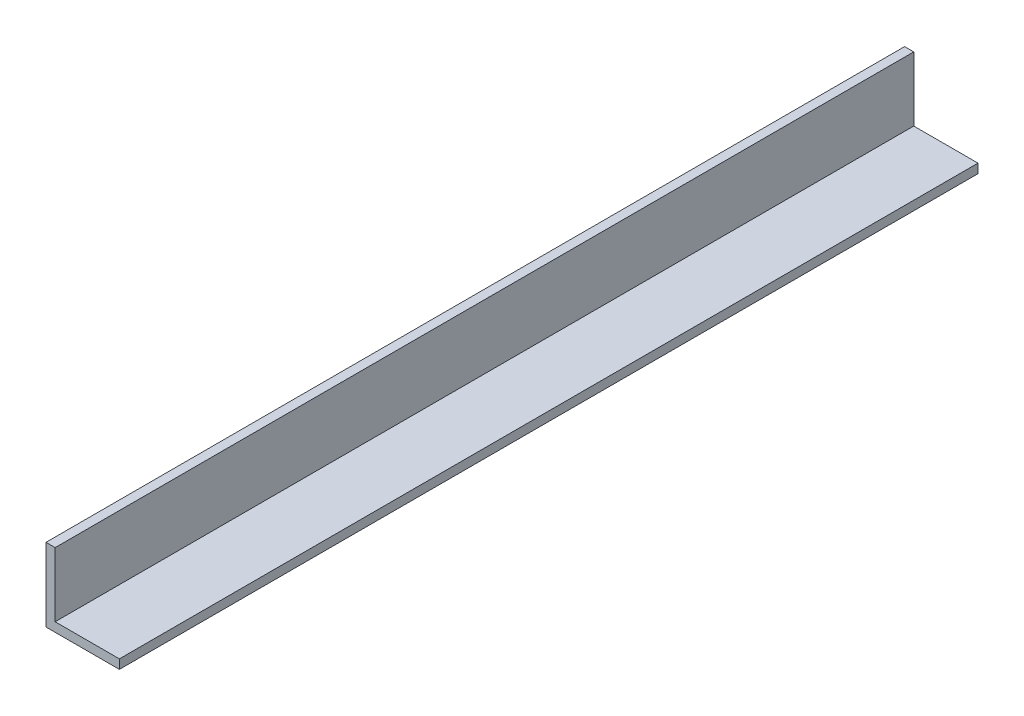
ISO-10303-21;
HEADER;
FILE_DESCRIPTION(('STEP AP214'),'2;1');
FILE_NAME('part.step','',(''),(''),'','','');
FILE_SCHEMA(('AUTOMOTIVE_DESIGN { 1 0 10303 214 1 1 1 1 }'));
ENDSEC;
DATA;
#1=APPLICATION_CONTEXT('core data for automotive mechanical design processes');
#2=APPLICATION_PROTOCOL_DEFINITION('international standard','automotive_design',2000,#1);
#3=PRODUCT_CONTEXT('',#1,'mechanical');
#4=PRODUCT('Part','Part','',(#3));
#5=PRODUCT_RELATED_PRODUCT_CATEGORY('part','',(#4));
#6=PRODUCT_DEFINITION_FORMATION('','',#4);
#7=PRODUCT_DEFINITION_CONTEXT('part definition',#1,'design');
#8=PRODUCT_DEFINITION('design','',#6,#7);
#9=PRODUCT_DEFINITION_SHAPE('','',#8);
#10=(LENGTH_UNIT() NAMED_UNIT(*) SI_UNIT(.MILLI.,.METRE.));
#11=(NAMED_UNIT(*) PLANE_ANGLE_UNIT() SI_UNIT($,.RADIAN.));
#12=(NAMED_UNIT(*) SI_UNIT($,.STERADIAN.) SOLID_ANGLE_UNIT());
#13=UNCERTAINTY_MEASURE_WITH_UNIT(LENGTH_MEASURE(1.E-05),#10,'distance_accuracy_value','');
#14=(GEOMETRIC_REPRESENTATION_CONTEXT(3) GLOBAL_UNCERTAINTY_ASSIGNED_CONTEXT((#13)) GLOBAL_UNIT_ASSIGNED_CONTEXT((#10,
#11,#12)) REPRESENTATION_CONTEXT('',''));
#15=CARTESIAN_POINT('',(0.,0.,0.));
#16=DIRECTION('',(0.,0.,1.));
#17=DIRECTION('',(1.,0.,0.));
#18=AXIS2_PLACEMENT_3D('',#15,#16,#17);
#19=CARTESIAN_POINT('',(0.,0.,445.77));
#20=DIRECTION('',(0.,1.,0.));
#21=DIRECTION('',(0.,0.,1.));
#22=AXIS2_PLACEMENT_3D('',#19,#20,#21);
#23=PLANE('',#22);
#24=DIRECTION('',(1.,0.,0.));
#25=VECTOR('',#24,1.);
#26=CARTESIAN_POINT('',(0.,0.,0.));
#27=LINE('',#26,#25);
#28=CARTESIAN_POINT('',(0.,0.,0.));
#29=VERTEX_POINT('',#28);
#30=CARTESIAN_POINT('',(38.1,0.,0.));
#31=VERTEX_POINT('',#30);
#32=EDGE_CURVE('E116',#29,#31,#27,.T.);
#33=ORIENTED_EDGE('',*,*,#32,.T.);
#34=DIRECTION('',(0.,0.,-1.));
#35=VECTOR('',#34,1.);
#36=CARTESIAN_POINT('',(38.1,0.,445.77));
#37=LINE('',#36,#35);
#38=CARTESIAN_POINT('',(38.1,0.,445.77));
#39=VERTEX_POINT('',#38);
#40=EDGE_CURVE('E11',#39,#31,#37,.T.);
#41=ORIENTED_EDGE('',*,*,#40,.F.);
#42=DIRECTION('',(1.,0.,0.));
#43=VECTOR('',#42,1.);
#44=CARTESIAN_POINT('',(0.,0.,445.77));
#45=LINE('',#44,#43);
#46=CARTESIAN_POINT('',(0.,0.,445.77));
#47=VERTEX_POINT('',#46);
#48=EDGE_CURVE('E126',#47,#39,#45,.T.);
#49=ORIENTED_EDGE('',*,*,#48,.F.);
#50=DIRECTION('',(0.,0.,-1.));
#51=VECTOR('',#50,1.);
#52=CARTESIAN_POINT('',(0.,0.,445.77));
#53=LINE('',#52,#51);
#54=EDGE_CURVE('E112',#47,#29,#53,.T.);
#55=ORIENTED_EDGE('',*,*,#54,.T.);
#56=EDGE_LOOP('',(#33,#41,#49,#55));
#57=FACE_BOUND('',#56,.T.);
#58=ADVANCED_FACE('F32',(#57),#23,.F.);
#59=CARTESIAN_POINT('',(38.1,0.,445.77));
#60=DIRECTION('',(-1.,0.,0.));
#61=DIRECTION('',(0.,0.,1.));
#62=AXIS2_PLACEMENT_3D('',#59,#60,#61);
#63=PLANE('',#62);
#64=DIRECTION('',(0.,1.,0.));
#65=VECTOR('',#64,1.);
#66=CARTESIAN_POINT('',(38.1,0.,0.));
#67=LINE('',#66,#65);
#68=CARTESIAN_POINT('',(38.1,4.7498,0.));
#69=VERTEX_POINT('',#68);
#70=EDGE_CURVE('E119',#31,#69,#67,.T.);
#71=ORIENTED_EDGE('',*,*,#70,.T.);
#72=DIRECTION('',(0.,0.,-1.));
#73=VECTOR('',#72,1.);
#74=CARTESIAN_POINT('',(38.1,4.7498,445.77));
#75=LINE('',#74,#73);
#76=CARTESIAN_POINT('',(38.1,4.7498,445.77));
#77=VERTEX_POINT('',#76);
#78=EDGE_CURVE('E40',#77,#69,#75,.T.);
#79=ORIENTED_EDGE('',*,*,#78,.F.);
#80=DIRECTION('',(0.,1.,0.));
#81=VECTOR('',#80,1.);
#82=CARTESIAN_POINT('',(38.1,0.,445.77));
#83=LINE('',#82,#81);
#84=EDGE_CURVE('E85',#39,#77,#83,.T.);
#85=ORIENTED_EDGE('',*,*,#84,.F.);
#86=ORIENTED_EDGE('',*,*,#40,.T.);
#87=EDGE_LOOP('',(#71,#79,#85,#86));
#88=FACE_BOUND('',#87,.T.);
#89=ADVANCED_FACE('F150',(#88),#63,.F.);
#90=CARTESIAN_POINT('',(38.1,4.7498,445.77));
#91=DIRECTION('',(0.,-1.,0.));
#92=DIRECTION('',(1.,0.,0.));
#93=AXIS2_PLACEMENT_3D('',#90,#91,#92);
#94=PLANE('',#93);
#95=DIRECTION('',(-1.,0.,0.));
#96=VECTOR('',#95,1.);
#97=CARTESIAN_POINT('',(38.1,4.7498,0.));
#98=LINE('',#97,#96);
#99=CARTESIAN_POINT('',(4.7498,4.7498,0.));
#100=VERTEX_POINT('',#99);
#101=EDGE_CURVE('E121',#69,#100,#98,.T.);
#102=ORIENTED_EDGE('',*,*,#101,.T.);
#103=DIRECTION('',(0.,0.,-1.));
#104=VECTOR('',#103,1.);
#105=CARTESIAN_POINT('',(4.7498,4.7498,445.77));
#106=LINE('',#105,#104);
#107=CARTESIAN_POINT('',(4.7498,4.7498,445.77));
#108=VERTEX_POINT('',#107);
#109=EDGE_CURVE('E107',#108,#100,#106,.T.);
#110=ORIENTED_EDGE('',*,*,#109,.F.);
#111=DIRECTION('',(-1.,0.,0.));
#112=VECTOR('',#111,1.);
#113=CARTESIAN_POINT('',(38.1,4.7498,445.77));
#114=LINE('',#113,#112);
#115=EDGE_CURVE('E98',#77,#108,#114,.T.);
#116=ORIENTED_EDGE('',*,*,#115,.F.);
#117=ORIENTED_EDGE('',*,*,#78,.T.);
#118=EDGE_LOOP('',(#102,#110,#116,#117));
#119=FACE_BOUND('',#118,.T.);
#120=ADVANCED_FACE('F132',(#119),#94,.F.);
#121=CARTESIAN_POINT('',(4.7498,4.7498,445.77));
#122=DIRECTION('',(-1.,0.,0.));
#123=DIRECTION('',(0.,-1.,0.));
#124=AXIS2_PLACEMENT_3D('',#121,#122,#123);
#125=PLANE('',#124);
#126=DIRECTION('',(0.,1.,0.));
#127=VECTOR('',#126,1.);
#128=CARTESIAN_POINT('',(4.7498,4.7498,0.));
#129=LINE('',#128,#127);
#130=CARTESIAN_POINT('',(4.7498,38.1,0.));
#131=VERTEX_POINT('',#130);
#132=EDGE_CURVE('E106',#100,#131,#129,.T.);
#133=ORIENTED_EDGE('',*,*,#132,.T.);
#134=DIRECTION('',(0.,0.,-1.));
#135=VECTOR('',#134,1.);
#136=CARTESIAN_POINT('',(4.7498,38.1,445.77));
#137=LINE('',#136,#135);
#138=CARTESIAN_POINT('',(4.7498,38.1,445.77));
#139=VERTEX_POINT('',#138);
#140=EDGE_CURVE('E103',#139,#131,#137,.T.);
#141=ORIENTED_EDGE('',*,*,#140,.F.);
#142=DIRECTION('',(0.,1.,0.));
#143=VECTOR('',#142,1.);
#144=CARTESIAN_POINT('',(4.7498,4.7498,445.77));
#145=LINE('',#144,#143);
#146=EDGE_CURVE('E92',#108,#139,#145,.T.);
#147=ORIENTED_EDGE('',*,*,#146,.F.);
#148=ORIENTED_EDGE('',*,*,#109,.T.);
#149=EDGE_LOOP('',(#133,#141,#147,#148));
#150=FACE_BOUND('',#149,.T.);
#151=ADVANCED_FACE('F104',(#150),#125,.F.);
#152=CARTESIAN_POINT('',(4.7498,38.1,445.77));
#153=DIRECTION('',(0.,-1.,0.));
#154=DIRECTION('',(0.,0.,-1.));
#155=AXIS2_PLACEMENT_3D('',#152,#153,#154);
#156=PLANE('',#155);
#157=DIRECTION('',(-1.,0.,0.));
#158=VECTOR('',#157,1.);
#159=CARTESIAN_POINT('',(4.7498,38.1,0.));
#160=LINE('',#159,#158);
#161=CARTESIAN_POINT('',(0.,38.1,0.));
#162=VERTEX_POINT('',#161);
#163=EDGE_CURVE('E71',#131,#162,#160,.T.);
#164=ORIENTED_EDGE('',*,*,#163,.T.);
#165=DIRECTION('',(0.,0.,-1.));
#166=VECTOR('',#165,1.);
#167=CARTESIAN_POINT('',(0.,38.1,445.77));
#168=LINE('',#167,#166);
#169=CARTESIAN_POINT('',(0.,38.1,445.77));
#170=VERTEX_POINT('',#169);
#171=EDGE_CURVE('E108',#170,#162,#168,.T.);
#172=ORIENTED_EDGE('',*,*,#171,.F.);
#173=DIRECTION('',(-1.,0.,0.));
#174=VECTOR('',#173,1.);
#175=CARTESIAN_POINT('',(4.7498,38.1,445.77));
#176=LINE('',#175,#174);
#177=EDGE_CURVE('E96',#139,#170,#176,.T.);
#178=ORIENTED_EDGE('',*,*,#177,.F.);
#179=ORIENTED_EDGE('',*,*,#140,.T.);
#180=EDGE_LOOP('',(#164,#172,#178,#179));
#181=FACE_BOUND('',#180,.T.);
#182=ADVANCED_FACE('F110',(#181),#156,.F.);
#183=CARTESIAN_POINT('',(0.,0.,445.77));
#184=DIRECTION('',(1.,0.,0.));
#185=DIRECTION('',(0.,0.,-1.));
#186=AXIS2_PLACEMENT_3D('',#183,#184,#185);
#187=PLANE('',#186);
#188=DIRECTION('',(0.,-1.,0.));
#189=VECTOR('',#188,1.);
#190=CARTESIAN_POINT('',(0.,0.,0.));
#191=LINE('',#190,#189);
#192=EDGE_CURVE('E77',#162,#29,#191,.T.);
#193=ORIENTED_EDGE('',*,*,#192,.T.);
#194=ORIENTED_EDGE('',*,*,#54,.F.);
#195=DIRECTION('',(0.,-1.,0.));
#196=VECTOR('',#195,1.);
#197=CARTESIAN_POINT('',(0.,0.,445.77));
#198=LINE('',#197,#196);
#199=EDGE_CURVE('E48',#170,#47,#198,.T.);
#200=ORIENTED_EDGE('',*,*,#199,.F.);
#201=ORIENTED_EDGE('',*,*,#171,.T.);
#202=EDGE_LOOP('',(#193,#194,#200,#201));
#203=FACE_BOUND('',#202,.T.);
#204=ADVANCED_FACE('F139',(#203),#187,.F.);
#205=CARTESIAN_POINT('',(38.1,0.,445.77));
#206=DIRECTION('',(0.,0.,1.));
#207=DIRECTION('',(1.,0.,0.));
#208=AXIS2_PLACEMENT_3D('',#205,#206,#207);
#209=PLANE('',#208);
#210=ORIENTED_EDGE('',*,*,#48,.T.);
#211=ORIENTED_EDGE('',*,*,#84,.T.);
#212=ORIENTED_EDGE('',*,*,#115,.T.);
#213=ORIENTED_EDGE('',*,*,#146,.T.);
#214=ORIENTED_EDGE('',*,*,#177,.T.);
#215=ORIENTED_EDGE('',*,*,#199,.T.);
#216=EDGE_LOOP('',(#210,#211,#212,#213,#214,#215));
#217=FACE_BOUND('',#216,.T.);
#218=ADVANCED_FACE('F94',(#217),#209,.T.);
#219=CARTESIAN_POINT('',(38.1,0.,0.));
#220=DIRECTION('',(0.,0.,1.));
#221=DIRECTION('',(1.,0.,0.));
#222=AXIS2_PLACEMENT_3D('',#219,#220,#221);
#223=PLANE('',#222);
#224=ORIENTED_EDGE('',*,*,#32,.F.);
#225=ORIENTED_EDGE('',*,*,#192,.F.);
#226=ORIENTED_EDGE('',*,*,#163,.F.);
#227=ORIENTED_EDGE('',*,*,#132,.F.);
#228=ORIENTED_EDGE('',*,*,#101,.F.);
#229=ORIENTED_EDGE('',*,*,#70,.F.);
#230=EDGE_LOOP('',(#224,#225,#226,#227,#228,#229));
#231=FACE_BOUND('',#230,.T.);
#232=ADVANCED_FACE('F135',(#231),#223,.F.);
#233=CLOSED_SHELL('',(#58,#89,#120,#151,#182,#204,#218,#232));
#234=MANIFOLD_SOLID_BREP('B2',#233);
#235=ADVANCED_BREP_SHAPE_REPRESENTATION('',(#18,#234),#14);
#236=SHAPE_DEFINITION_REPRESENTATION(#9,#235);
ENDSEC;
END-ISO-10303-21;
